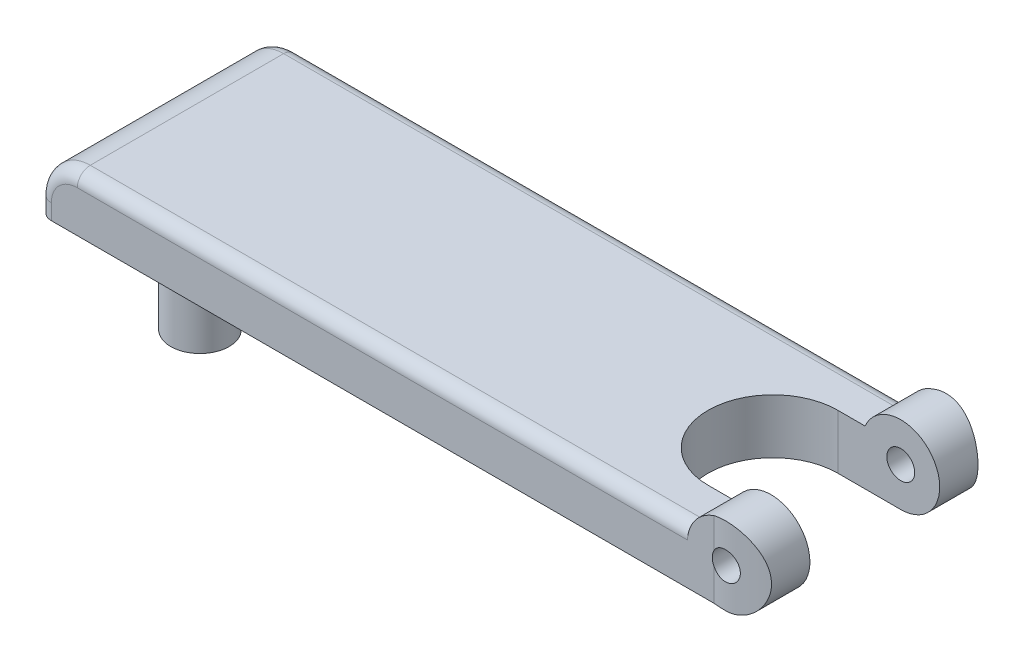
from build123d import *

# Parameters (mm, degrees)
ESQUISSE1_W             = 53
ESQUISSE1_H             = 17
EXTRUSION1_DEPTH        = 4.2
ESQUISSE2_R             = 3
EXTRUSION2_DEPTH        = 17
ESQUISSE5_R             = 1.075
ENL_V_MAT_EXTRU_2_DEPTH = 17
ESQUISSE4_OUTSIDE_W     = 69.766
ESQUISSE4_OUTSIDE_H     = 30.766
ENL_V_MAT_EXTRU_1_DEPTH = 17
CONG_1_R                = 3
CONG_3_R                = 1
ESQUISSE6_R             = 2.25
ESQUISSE6_R_2           = 0.9
EXTRUSION3_DEPTH        = 10


with BuildPart() as part:
    # Esquisse1 → Extrusion1 (new body)
    with BuildSketch(Plane(origin=(0, 0, 0), x_dir=(1, 0, 0), z_dir=(0, 1, 0))):
        with Locations((-26.5, 0)):
            Rectangle(ESQUISSE1_W, ESQUISSE1_H)
    extrude(amount=EXTRUSION1_DEPTH)

    # Esquisse2 → Extrusion2 (add)
    with BuildSketch(Plane.XY.offset(8.5)):
        with Locations((0, 3)):
            Circle(ESQUISSE2_R)
    extrude(amount=-EXTRUSION2_DEPTH)

    # Esquisse5 → Enl_v. mat.-Extru.2 (cut)
    with BuildSketch(Plane.XY.offset(8.5)):
        with Locations((0, 3)):
            Circle(ESQUISSE5_R)
    extrude(amount=-ENL_V_MAT_EXTRU_2_DEPTH, mode=Mode.SUBTRACT)

    # Esquisse4 outside → Enl_v. mat.-Extru.1 (cut)
    with BuildSketch(Plane.XZ):
        with Locations((-25, 0)):
            Rectangle(ESQUISSE4_OUTSIDE_W, ESQUISSE4_OUTSIDE_H)
        with BuildLine():
            Line((-0.920597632, 8.45), (-54.680244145, 8.45))
            Line((-54.680244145, 8.45), (-54.680244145, -8.45))
            Line((-54.680244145, -8.45), (-0.920597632, -8.45))
            ThreePointArc((-0.920597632, -8.45), (3.440344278, -7.772646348), (6.873863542, -5))
            Line((6.873863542, -5), (-4.85, -5))
            ThreePointArc((-4.85, -5), (-9.85, 0), (-4.85, 5))
            Line((-4.85, 5), (6.873863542, 5))
            ThreePointArc((6.873863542, 5), (3.440344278, 7.772646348), (-0.920597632, 8.45))
        make_face(mode=Mode.SUBTRACT)
    extrude(amount=-ENL_V_MAT_EXTRU_1_DEPTH, mode=Mode.SUBTRACT)

    # Cong_1
    cong_1_edges = [part.edges().sort_by_distance(p)[0] for p in [
        (-53, 4.2, 0),
    ]]
    fillet(cong_1_edges, radius=CONG_1_R)

    # Cong_3
    cong_3_edges = [part.edges().sort_by_distance(p)[0] for p in [
        (-26.374772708, 4.2, 8.45),
        (-53, 0.6, 8.45),
        (-52.121320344, 3.321320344, 8.45),
        (-52.121320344, 3.321320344, -8.45),
        (-26.374772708, 4.2, -8.45),
        (-53, 0.6, -8.45),
    ]]
    fillet(cong_3_edges, radius=CONG_3_R)

    # Esquisse6 → Extrusion3 (add)
    with BuildSketch(Plane.XZ):
        with Locations(Location((-49, 0, 0), (0, 0, 90))):
            Circle(ESQUISSE6_R)
        with Locations(Location((-49, 0, 0), (0, 0, 270))):
            Circle(ESQUISSE6_R_2, mode=Mode.SUBTRACT)
    extrude(amount=EXTRUSION3_DEPTH)


solid = part.part
